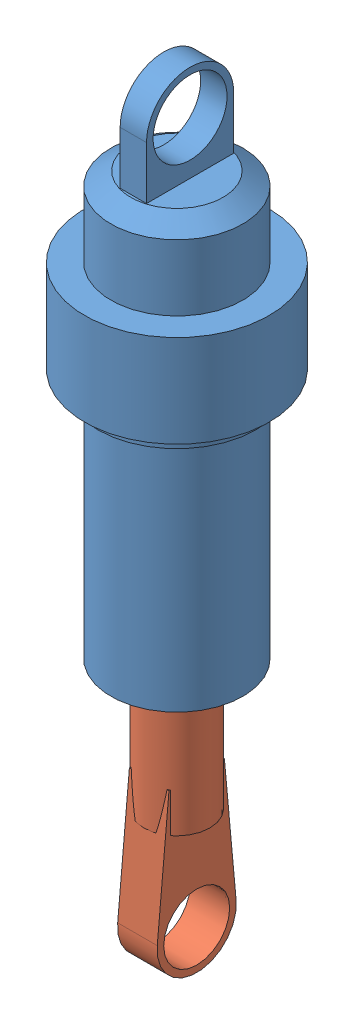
SolidWorks assembly Shock Assembly.SLDASM, configuration Default (file format 10000). Lengths in mm.
Overall size (14 59.18 14).
2 component instances, 2 part files, 2 mates.
Components (placement in the parent):
- amortiguador superior-1: amortiguador superior.SLDPRT [Default] at (17.7703 9.3381 36.1192) size (14 39.3 14)
- amortiguador vastago-1: amortiguador vastago.SLDPRT [Default] at (17.7703 9.4558 36.1192) x (-1 0 0) z (0 0 1) size (5 48 6)
Mates (geometry in assembly coordinates):
- Concentric1: concentric aligned: cylinder of amortiguador superior-1 through (17.7703 9.3381 36.1192) axis (0 -1 0) radius 2; cylinder of amortiguador vastago-1 through (17.7703 37.4558 36.1192) axis (0 -1 0) radius 1.5
- Parallel1: parallel aligned: plane of amortiguador superior-1 through (18.7703 9.3381 36.1192) normal (1 0 0); plane of amortiguador vastago-1 through (19.2703 9.4558 36.1192) normal (1 0 0)
